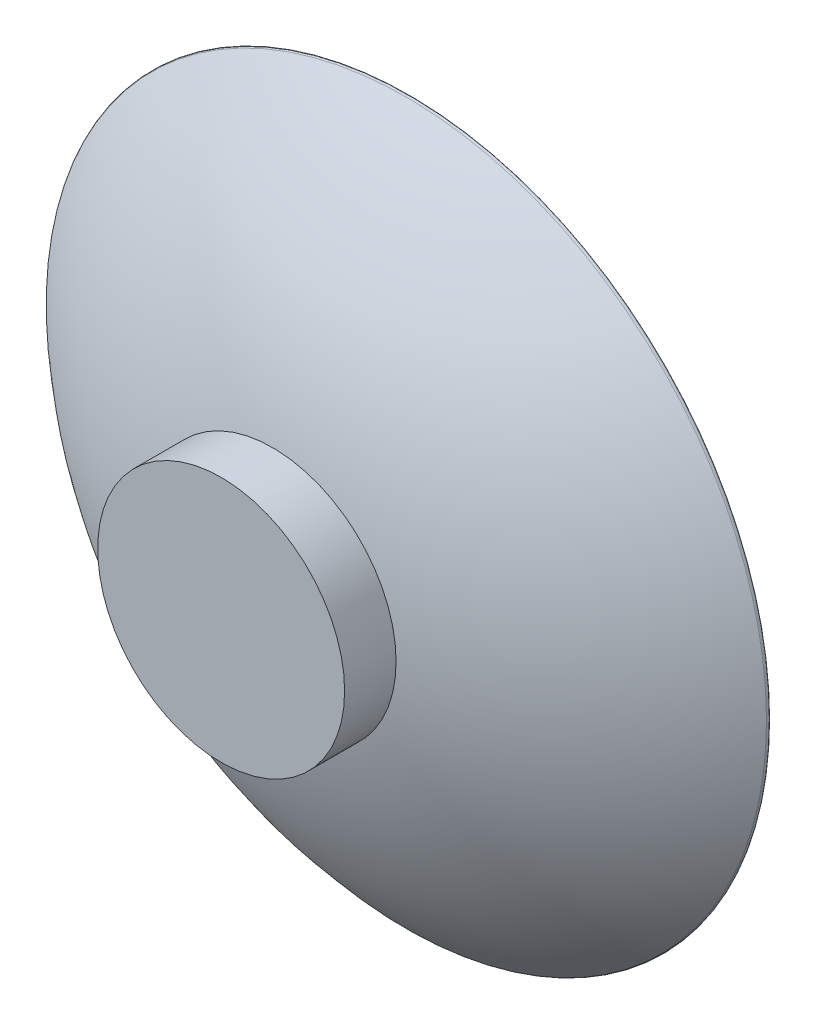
from build123d import *

# Parameters (mm, degrees)
CROQUIS1_R              = 60
SALIENTE_EXTRUIR1_DEPTH = 25


with BuildPart() as part:
    # Croquis1 → Saliente-Extruir1 (new body)
    with BuildSketch(Plane.XY):
        Circle(CROQUIS1_R)
    extrude(amount=SALIENTE_EXTRUIR1_DEPTH)

    # Croquis3 → Revoluci_n11 (revolve)
    with BuildSketch(Plane(origin=(0, 0, 0), x_dir=(0, 0, -1), z_dir=(1, 0, 0)), mode=Mode.PRIVATE) as revoluci_n11_sk:
        with BuildLine():
            Line((0, 0), (1.999271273, 0))
            Line((1.999271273, 0), (1.999271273, 0.053984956))
            ThreePointArc((1.999271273, 0.053984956), (1.92186373, 4.213303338), (1.914234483, 8.373334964))
            ThreePointArc((1.914234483, 8.373334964), (3.945531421, 10.343851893), (1.972704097, 12.372905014))
            ThreePointArc((1.972704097, 12.372905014), (1.975284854, 12.48553457), (1.977916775, 12.598162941))
            ThreePointArc((1.977916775, 12.598162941), (4.042490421, 14.533786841), (2.104518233, 16.596156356))
            ThreePointArc((2.104518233, 16.596156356), (2.109017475, 16.708725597), (2.113567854, 16.821292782))
            ThreePointArc((2.113567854, 16.821292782), (4.210818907, 18.721461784), (2.308264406, 20.816549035))
            ThreePointArc((2.308264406, 20.816549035), (2.314680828, 20.929025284), (2.321148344, 21.041498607))
            ThreePointArc((2.321148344, 21.041498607), (4.45046802, 22.905661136), (2.583883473, 25.032857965))
            ThreePointArc((2.583883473, 25.032857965), (2.592215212, 25.145208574), (2.600597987, 25.257555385))
            ThreePointArc((2.600597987, 25.257555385), (4.761368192, 27.085170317), (2.931295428, 29.243859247))
            ThreePointArc((2.931295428, 29.243859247), (2.941540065, 29.356051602), (2.951835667, 29.468239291))
            ThreePointArc((2.951835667, 29.468239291), (5.143429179, 31.25877611), (3.350399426, 33.448330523))
            ThreePointArc((3.350399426, 33.448330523), (3.362553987, 33.560332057), (3.374759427, 33.672328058))
            ThreePointArc((3.374759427, 33.672328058), (5.596540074, 35.425267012), (3.841073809, 37.645051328))
            ThreePointArc((3.841073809, 37.645051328), (3.855134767, 37.75682953), (3.869246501, 37.868601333))
            ThreePointArc((3.869246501, 37.868601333), (6.120569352, 39.583433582), (4.403176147, 41.832803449))
            ThreePointArc((4.403176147, 41.832803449), (4.419139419, 41.944325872), (4.435153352, 42.055841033))
            ThreePointArc((4.435153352, 42.055841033), (6.715364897, 43.7320688), (5.036543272, 46.010371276))
            ThreePointArc((5.036543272, 46.010371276), (5.054404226, 46.121605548), (5.072315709, 46.232831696))
            ThreePointArc((5.072315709, 46.232831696), (7.380754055, 47.86996841), (5.740991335, 50.176542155))
            ThreePointArc((5.740991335, 50.176542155), (5.760744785, 50.287455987), (5.780548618, 50.398360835))
            ThreePointArc((5.780548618, 50.398360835), (8.116543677, 51.995931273), (6.516315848, 54.33010674))
            ThreePointArc((6.516315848, 54.33010674), (6.53795606, 54.440667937), (6.559646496, 54.551219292))
            ThreePointArc((6.559646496, 54.551219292), (8.922520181, 56.108759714), (7.362291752, 58.469859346))
            ThreePointArc((7.362291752, 58.469859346), (7.385812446, 58.580035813), (7.409383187, 58.690201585))
            ThreePointArc((7.409383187, 58.690201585), (9.798449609, 60.207259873), (8.27867348, 62.594598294))
            ThreePointArc((8.27867348, 62.594598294), (8.304067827, 62.704358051), (8.329512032, 62.81410626))
            ThreePointArc((8.329512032, 62.81410626), (10.744077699, 64.290242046), (9.265195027, 66.703126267))
            ThreePointArc((9.265195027, 66.703126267), (9.292455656, 66.812437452), (9.319765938, 66.921736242))
            ThreePointArc((9.319765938, 66.921736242), (11.759129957, 68.356521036), (10.321570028, 70.79425065))
            ThreePointArc((10.321570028, 70.79425065), (10.350689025, 70.903081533), (10.379857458, 71.011899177))
            ThreePointArc((10.379857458, 71.011899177), (12.843311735, 72.404916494), (11.447491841, 74.866783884))
            ThreePointArc((11.447491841, 74.866783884), (11.478460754, 74.975102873), (11.50947887, 75.083407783))
            ThreePointArc((11.50947887, 75.083407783), (13.99630832, 76.434253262), (12.642633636, 78.919543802))
            ThreePointArc((12.642633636, 78.919543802), (12.675443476, 79.027319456), (12.708302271, 79.135080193))
            ThreePointArc((12.708302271, 79.135080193), (15.217785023, 80.443361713), (13.90664849, 82.95135398))
            Line((13.90664849, 82.95135398), (13.97597967, 83.165740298))
            ThreePointArc((13.97597967, 83.165740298), (16.507387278, 84.431078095), (15.239169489, 86.961044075))
            ThreePointArc((15.239169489, 86.961044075), (15.275632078, 87.067639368), (15.312143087, 87.174218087))
            ThreePointArc((15.312143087, 87.174218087), (17.86474074, 88.396244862), (16.639809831, 90.947450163))
            ThreePointArc((16.639809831, 90.947450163), (16.678083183, 91.053408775), (16.716404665, 91.159349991))
            ThreePointArc((16.716404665, 91.159349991), (19.289451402, 92.337711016), (18.108162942, 94.90941508))
            ThreePointArc((18.108162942, 94.90941508), (18.148235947, 95.014706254), (18.188356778, 95.119979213))
            ThreePointArc((18.188356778, 95.119979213), (20.781105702, 96.254332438), (19.643802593, 98.845788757))
            Line((19.643802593, 98.845788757), (19.727572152, 99.054956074))
            ThreePointArc((19.727572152, 99.054956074), (22.339270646, 100.144972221), (21.246283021, 102.755428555))
            ThreePointArc((21.246283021, 102.755428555), (21.289919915, 102.859293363), (21.333603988, 102.963138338))
            ThreePointArc((21.333603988, 102.963138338), (23.963493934, 104.008500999), (22.915139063, 106.637199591))
            ThreePointArc((22.915139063, 106.637199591), (22.96053916, 106.740305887), (23.00598609, 106.843391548))
            ThreePointArc((23.00598609, 106.843391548), (25.65330409, 107.843797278), (24.649886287, 110.489975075))
            ThreePointArc((24.649886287, 110.489975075), (24.697036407, 110.592292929), (24.744233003, 110.694589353))
            ThreePointArc((24.744233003, 110.694589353), (27.408210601, 111.649747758), (26.450021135, 114.312636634))
            ThreePointArc((26.450021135, 114.312636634), (26.498907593, 114.414136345), (26.547840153, 114.515613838))
            ThreePointArc((26.547840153, 114.515613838), (29.227704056, 115.425247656), (28.315021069, 118.104074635))
            ThreePointArc((28.315021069, 118.104074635), (28.365629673, 118.20472674), (28.416283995, 118.305355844))
            ThreePointArc((28.416283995, 118.305355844), (31.111256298, 119.169201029), (30.244344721, 121.863188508))
            Line((30.244344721, 121.863188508), (30.34902216, 122.062715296))
            ThreePointArc((30.34902216, 122.062715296), (33.058320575, 122.880521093), (32.237432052, 125.588887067))
            ThreePointArc((32.237432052, 125.588887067), (32.291440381, 125.687756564), (32.345493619, 125.786601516))
            ThreePointArc((32.345493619, 125.786601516), (35.068331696, 126.558130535), (34.293704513, 129.280088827))
            ThreePointArc((34.293704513, 129.280088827), (34.349389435, 129.378023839), (34.40511884, 129.475933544))
            ThreePointArc((34.40511884, 129.475933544), (37.140706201, 130.200961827), (36.412565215, 132.935722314))
            ThreePointArc((36.412565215, 132.935722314), (36.469910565, 133.032694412), (36.527299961, 133.12964045))
            ThreePointArc((36.527299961, 133.12964045), (39.274842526, 133.807957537), (38.5933991, 136.55472638))
            ThreePointArc((38.5933991, 136.55472638), (38.652388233, 136.650707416), (38.711420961, 136.746661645))
            ThreePointArc((38.711420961, 136.746661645), (41.470121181, 137.378070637), (40.835573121, 140.13605051))
            ThreePointArc((40.835573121, 140.13605051), (40.896188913, 140.231012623), (40.956847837, 140.32594719))
            ThreePointArc((40.956847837, 140.32594719), (43.725904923, 140.910264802), (43.138436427, 143.678655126))
            ThreePointArc((43.138436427, 143.678655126), (43.200661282, 143.77257075), (43.262928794, 143.866458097))
            ThreePointArc((43.262928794, 143.866458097), (46.041538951, 144.403514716), (45.501320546, 147.181511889))
            ThreePointArc((45.501320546, 147.181511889), (45.565136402, 147.274353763), (45.628994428, 147.367166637))
            ThreePointArc((45.628994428, 147.367166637), (48.416351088, 147.856806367), (47.923539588, 150.643603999))
            ThreePointArc((47.923539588, 150.643603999), (47.988927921, 150.735345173), (48.054357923, 150.827056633))
            ThreePointArc((48.054357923, 150.827056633), (50.84965198, 151.269137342), (50.404390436, 154.063926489))
            ThreePointArc((50.404390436, 154.063926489), (50.471332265, 154.154540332), (50.538315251, 154.245123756))
            ThreePointArc((50.538315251, 154.245123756), (53.340735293, 154.639517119), (52.943152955, 157.441486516))
            ThreePointArc((52.943152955, 157.441486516), (53.011628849, 157.530946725), (53.080145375, 157.620375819))
            ThreePointArc((53.080145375, 157.620375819), (55.888877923, 157.966967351), (55.5390902, 160.77530365))
            ThreePointArc((55.5390902, 160.77530365), (55.609080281, 160.863584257), (55.679110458, 160.951833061))
            ThreePointArc((55.679110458, 160.951833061), (58.493340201, 161.250522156), (58.191448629, 164.06441016))
            ThreePointArc((58.191448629, 164.06441016), (58.262932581, 164.151485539), (58.334456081, 164.238528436))
            ThreePointArc((58.334456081, 164.238528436), (61.15336611, 164.489228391), (60.899458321, 167.307851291))
            ThreePointArc((60.899458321, 167.307851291), (60.972415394, 167.393696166), (61.045411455, 167.479507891))
            ThreePointArc((61.045411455, 167.479507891), (63.868183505, 167.682145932), (63.662333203, 170.504685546))
            ThreePointArc((63.662333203, 170.504685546), (63.736742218, 170.589274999), (63.811189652, 170.673830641))
            ThreePointArc((63.811189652, 170.673830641), (66.637004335, 170.828347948), (66.479271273, 173.653984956))
            ThreePointArc((66.479271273, 173.653984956), (66.412643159, 175.066628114), (65, 175))
            ThreePointArc((65, 175), (15.55259117, 93.794751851), (0, 0))
        make_face()
    revolve(revoluci_n11_sk.sketch.rotate(Axis((0, 0, 0), (0, 0, -1)), 90), axis=Axis((0, 0, 0), (0, 0, -1)))


with BuildPart() as body_2:
    # Croquis4 → Revoluci_n12 (revolve)
    with BuildSketch(Plane(origin=(0, 0, 0), x_dir=(0, 0, -1), z_dir=(1, 0, 0))):
        with BuildLine():
            Line((1.58095394, 0), (81.58095394, 0))
            ThreePointArc((81.58095394, 0), (41.58095394, 40.931779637), (1.58095394, 0))
        make_face()
    revolve(axis=Axis((0, 0, -1.58095394), (0, 0, -1)))


solid = Compound([part.part, body_2.part])
